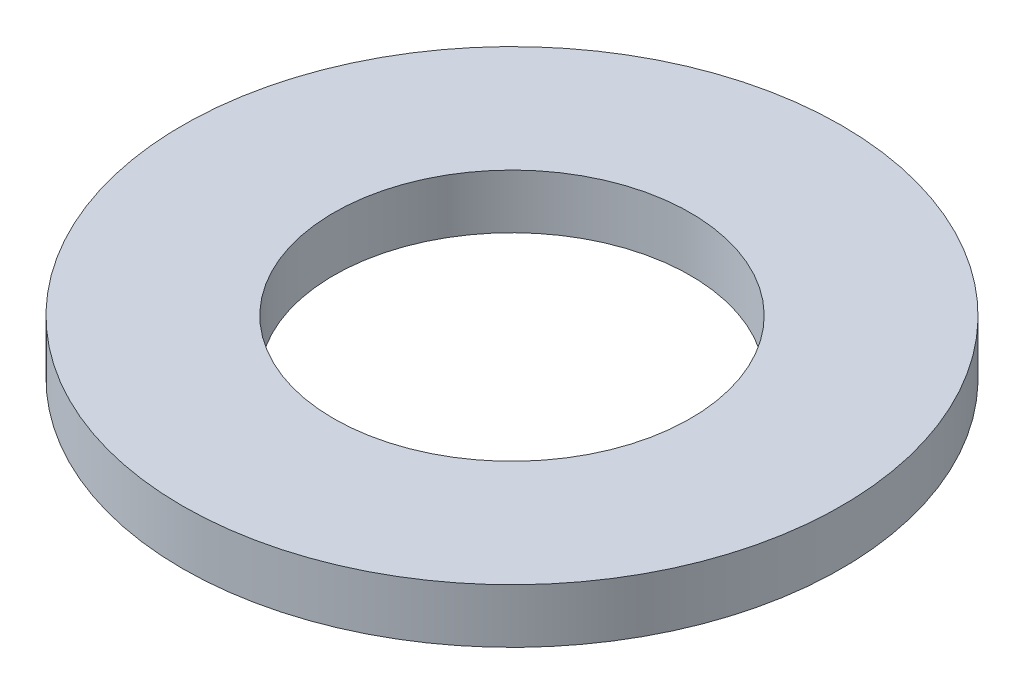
from build123d import *

# Parameters (mm, degrees)
SKETCH1_R      = 42.5
SKETCH1_R_2    = 23
EXTRUDE1_DEPTH = 7


with BuildPart() as part:
    # Sketch1 → Extrude1 (new body)
    with BuildSketch(Plane(origin=(0, 0, 0), x_dir=(1, 0, 0), z_dir=(0, 1, 0))):
        with Locations(Location((0, 0, 0), (0, 0, 270))):
            Circle(SKETCH1_R)
        with Locations(Location((0, 0, 0), (0, 0, 270))):
            Circle(SKETCH1_R_2, mode=Mode.SUBTRACT)
    extrude(amount=EXTRUDE1_DEPTH)


solid = part.part
